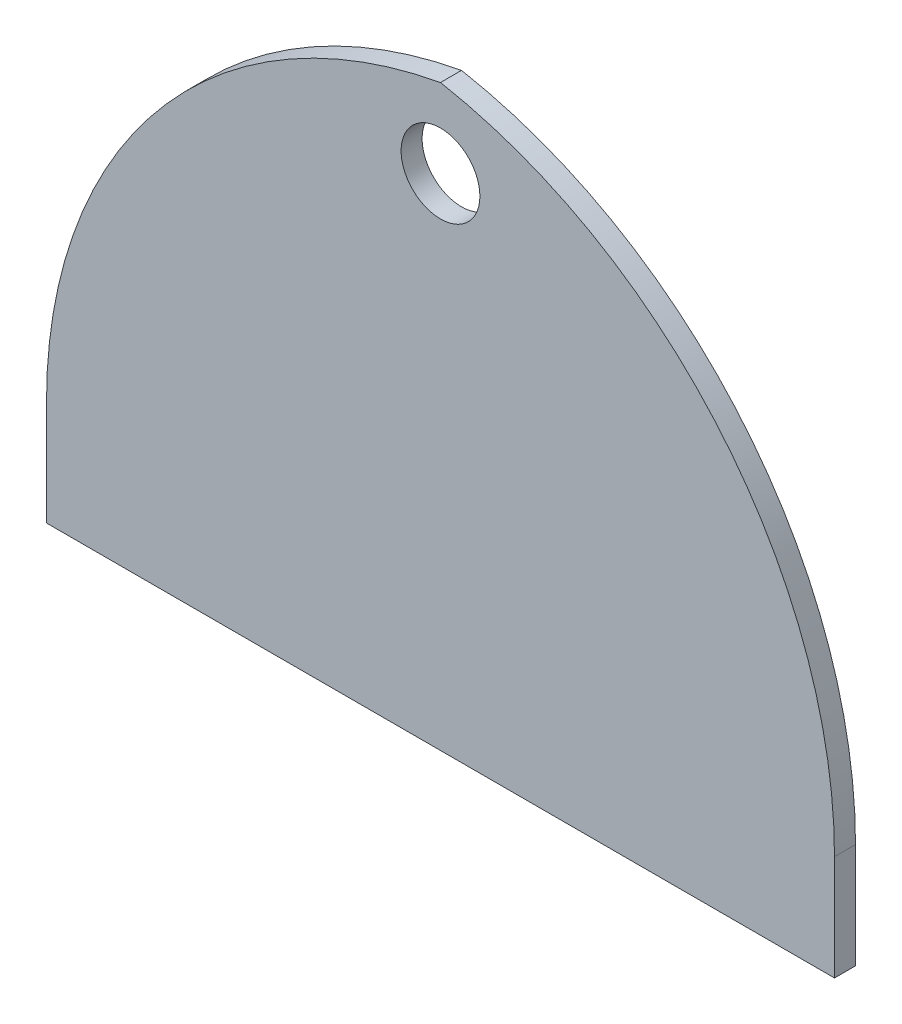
from build123d import *

# Parameters (mm, degrees)
CROQUIS1_R              = 150
SALIENTE_EXTRUIR1_DEPTH = 80


with BuildPart() as part:
    # Croquis1 → Saliente-Extruir1 (new body)
    with BuildSketch(Plane.XY):
        with BuildLine():
            Line((-1481.701404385, -491.370616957), (-1481.701404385, -91.370616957))
            ThreePointArc((-1481.701404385, -91.370616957), (-1057.652284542, 1081.138398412), (18.298595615, 1711.158041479))
            ThreePointArc((18.298595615, 1711.158041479), (1094.249475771, 1081.138398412), (1518.298595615, -91.370616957))
            Line((1518.298595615, -91.370616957), (1518.298595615, -491.370616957))
            Line((1518.298595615, -491.370616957), (-1481.701404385, -491.370616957))
        make_face()
        with Locations((18.298595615, 1411.158041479)):
            Circle(CROQUIS1_R, mode=Mode.SUBTRACT)
    extrude(amount=SALIENTE_EXTRUIR1_DEPTH)


solid = part.part
